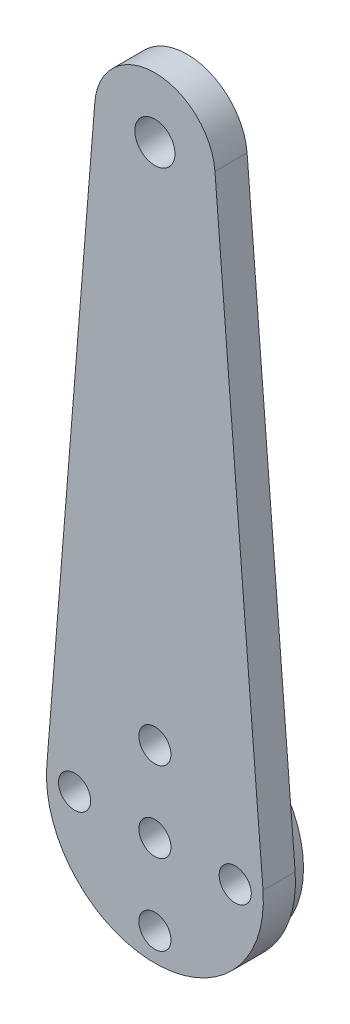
from build123d import *

# Parameters (mm, degrees)
SKETCH2_R           = 12.5
SKETCH2_R_2         = 2
BOSS_EXTRUDE1_DEPTH = 2
SKETCH3_R           = 4.5
SKETCH3_R_2         = 3.5
BOSS_EXTRUDE2_DEPTH = 3
SKETCH4_R           = 2
SKETCH4_R_2         = 2.5
BOSS_EXTRUDE3_DEPTH = 4


with BuildPart() as part:
    # Sketch2 → Boss-Extrude1 (new body)
    with BuildSketch(Plane.XY):
        Circle(SKETCH2_R)
        with Locations((-10, 0)):
            Circle(SKETCH2_R_2, mode=Mode.SUBTRACT)
        with Locations((0, -10)):
            Circle(SKETCH2_R_2, mode=Mode.SUBTRACT)
        with Locations((10, 0)):
            Circle(SKETCH2_R_2, mode=Mode.SUBTRACT)
        with Locations((0, 10)):
            Circle(SKETCH2_R_2, mode=Mode.SUBTRACT)
        Circle(SKETCH2_R_2, mode=Mode.SUBTRACT)
    extrude(amount=BOSS_EXTRUDE1_DEPTH)

    # Sketch3 → Boss-Extrude2 (add)
    with BuildSketch(Plane(origin=(0, 0, 0), x_dir=(-1, 0, 0), z_dir=(0, 0, -1))):
        with Locations(Location((0, 0, 0), (0, 0, 180))):
            Circle(SKETCH3_R)
        Circle(SKETCH3_R_2, mode=Mode.SUBTRACT)
    extrude(amount=BOSS_EXTRUDE2_DEPTH)


with BuildPart() as body_2:
    # Sketch4 → Boss-Extrude3 (new body)
    with BuildSketch(Plane.XY.offset(2)):
        with BuildLine():
            Line((-7.475961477, 75.6), (-13.456730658, 1.08))
            ThreePointArc((-13.456730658, 1.08), (0, -13.5), (13.456730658, 1.08))
            Line((13.456730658, 1.08), (7.475961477, 75.6))
            ThreePointArc((7.475961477, 75.6), (0, 82.5), (-7.475961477, 75.6))
        make_face()
        with Locations((10, 0)):
            Circle(SKETCH4_R, mode=Mode.SUBTRACT)
        with Locations((0, -10)):
            Circle(SKETCH4_R, mode=Mode.SUBTRACT)
        with Locations((-10, 0)):
            Circle(SKETCH4_R, mode=Mode.SUBTRACT)
        with Locations((0, 10)):
            Circle(SKETCH4_R, mode=Mode.SUBTRACT)
        with Locations((0, 75)):
            Circle(SKETCH4_R_2, mode=Mode.SUBTRACT)
        Circle(SKETCH4_R, mode=Mode.SUBTRACT)
    extrude(amount=BOSS_EXTRUDE3_DEPTH)


solid = Compound([part.part, body_2.part])
